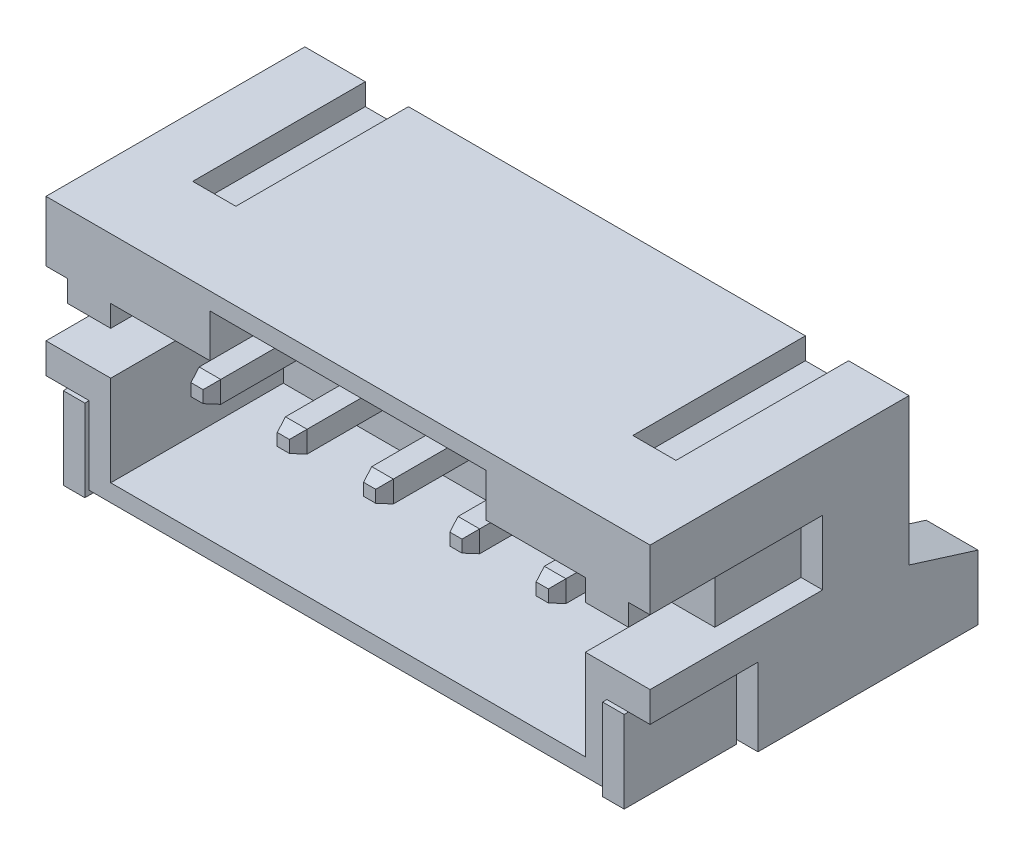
from build123d import *
from OCP.BRepFilletAPI import BRepFilletAPI_MakeChamfer

# Parameters (mm, degrees)
EXTRUDE_1_DEPTH                     = 7
SKETCH_2_W                          = 0.5
SKETCH_2_H                          = 1.5
CUT_EXTRUDE_2_DEPTH                 = 4
SKETCH_3_W                          = 11.6
SKETCH_3_H                          = 1.6
CUT_EXTRUDE_3_DEPTH                 = 12.658473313
SKETCH_5_W                          = 0.9
SKETCH_5_H                          = 1.8
CUT_EXTRUDE_5_DEPTH                 = 2.5
EXTRUDE_4_DEPTH                     = 0.25
CHAMFER_1_SIZE                      = 0.3
CHAMFER_1_SIZE2                     = 0.10919107
EXTRUDE_6_DEPTH                     = 0.1
EXTRUDE_6_DEPTH_BACK                = 2.5
SKETCH_6_W                          = 0.5
SKETCH_6_H                          = 1.9
PATTERN_LINEAR_1_COUNT              = 5
PATTERN_LINEAR_1_PITCH              = 2
CHAMFER_1_OF_PATTERN_LINEAR_1_SIZE  = 0.3
CHAMFER_1_OF_PATTERN_LINEAR_1_SIZE2 = 0.10919107
SKETCH_7_W                          = 1
SKETCH_7_H                          = 4
CUT_EXTRUDE_7_DEPTH                 = 0.5


with BuildPart() as part:
    # Sketch 1 → Extrude 1 (new, symmetric)
    with BuildSketch(Plane(origin=(0, 0, 0), x_dir=(0, 0, -1), z_dir=(1, 0, 0))):
        Polygon((7.6, 1.6), (6, 2.1), (6, 5.5), (0, 5.5), (0, 3.6), (2, 3.6), (2, 2.6), (0, 2.6), (0, 0.1), (7.6, 0.1), align=None)
    extrude(amount=EXTRUDE_1_DEPTH, both=True)

    # Sketch 2 → Cut-Extrude 2 (cut)
    with BuildSketch(Plane.XY):
        Polygon((-5.5, 0.5), (5.5, 0.5), (5.5, 4.1), (3.2, 4.1), (3.2, 5.1), (-3.2, 5.1), (-3.2, 4.1), (-5.5, 4.1), align=None)
        with Locations((-6.75, 3.35)):
            Rectangle(SKETCH_2_W, SKETCH_2_H)
        with Locations((6.75, 3.35)):
            Rectangle(SKETCH_2_W, SKETCH_2_H)
    extrude(amount=-CUT_EXTRUDE_2_DEPTH, mode=Mode.SUBTRACT)

    # Sketch 3 → Cut-Extrude 3 (cut, through all)
    with BuildSketch(Plane(origin=(0, 5.5, 0), x_dir=(1, 0, 0), z_dir=(0, 1, 0))):
        with Locations((0, 6.8)):
            Rectangle(SKETCH_3_W, SKETCH_3_H)
    extrude(amount=-CUT_EXTRUDE_3_DEPTH, mode=Mode.SUBTRACT)

    # Sketch 5 → Cut-Extrude 5 (cut)
    with BuildSketch(Plane.XY):
        with Locations((-6.55, 1)):
            Rectangle(SKETCH_5_W, SKETCH_5_H)
        with Locations((6.55, 1)):
            Rectangle(SKETCH_5_W, SKETCH_5_H)
    extrude(amount=-CUT_EXTRUDE_5_DEPTH, mode=Mode.SUBTRACT)

    # Sketch 4 → Extrude 4 (add, symmetric)
    with BuildSketch(Plane.ZY.offset(4)):
        with BuildLine():
            Line((-0.5, 2.55), (-5.6, 2.55))
            ThreePointArc((-5.6, 2.55), (-5.953553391, 2.403553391), (-6.1, 2.05))
            Line((-6.1, 2.05), (-6.1, 1))
            ThreePointArc((-6.1, 1), (-6.392893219, 0.292893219), (-7.1, 0))
            Line((-7.1, 0), (-8.6, 0))
            Line((-8.6, 0), (-8.6, 0.5))
            Line((-8.6, 0.5), (-7.1, 0.5))
            ThreePointArc((-7.1, 0.5), (-6.746446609, 0.646446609), (-6.6, 1))
            Line((-6.6, 1), (-6.6, 2.05))
            ThreePointArc((-6.6, 2.05), (-6.307106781, 2.757106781), (-5.6, 3.05))
            Line((-5.6, 3.05), (-0.5, 3.05))
            Line((-0.5, 3.05), (-0.5, 2.55))
        make_face()
    extrude_4 = extrude(amount=EXTRUDE_4_DEPTH, both=True)

    # Chamfer 1: one chamfer whose edges measure the first distance from different faces: ONE call of the kernel's chamfer builder (chamfer() names one face for all edges)
    chamfer_1_edges_1 = [part.edges().sort_by_distance(p)[0] for p in [
        (-4, 3.05, -0.5),
    ]]
    chamfer_1_side_1 = [part.faces().sort_by_distance(p)[0] for p in [
        (-4, 3.05, -2.25),
    ]]
    chamfer_1_edges_2 = [part.edges().sort_by_distance(p)[0] for p in [
        (-4.25, 2.8, -0.5),
    ]]
    chamfer_1_side_2 = [part.faces().sort_by_distance(p)[0] for p in [
        (-4.25, 2.8, -2.25),
    ]]
    chamfer_1_edges_3 = [part.edges().sort_by_distance(p)[0] for p in [
        (-3.75, 2.8, -0.5),
    ]]
    chamfer_1_side_3 = [part.faces().sort_by_distance(p)[0] for p in [
        (-3.75, 2.8, -2.25),
    ]]
    chamfer_1_edges_4 = [part.edges().sort_by_distance(p)[0] for p in [
        (-4, 2.55, -0.5),
    ]]
    chamfer_1_side_4 = [part.faces().sort_by_distance(p)[0] for p in [
        (-4, 2.55, -2.25),
    ]]
    chamfer_1 = BRepFilletAPI_MakeChamfer(part.part.solid().wrapped)
    for e in chamfer_1_edges_1:
        chamfer_1.Add(CHAMFER_1_SIZE, CHAMFER_1_SIZE2, e.wrapped, chamfer_1_side_1[0].wrapped)  # the first distance lies on this face
    for e in chamfer_1_edges_2:
        chamfer_1.Add(CHAMFER_1_SIZE, CHAMFER_1_SIZE2, e.wrapped, chamfer_1_side_2[0].wrapped)  # the first distance lies on this face
    for e in chamfer_1_edges_3:
        chamfer_1.Add(CHAMFER_1_SIZE, CHAMFER_1_SIZE2, e.wrapped, chamfer_1_side_3[0].wrapped)  # the first distance lies on this face
    for e in chamfer_1_edges_4:
        chamfer_1.Add(CHAMFER_1_SIZE, CHAMFER_1_SIZE2, e.wrapped, chamfer_1_side_4[0].wrapped)  # the first distance lies on this face
    add(Compound.cast(chamfer_1.Shape()), mode=Mode.REPLACE)

    # Sketch 6 → Extrude 6 (add, two sides: drawn at the far end of the back side and taken through both)
    with BuildSketch(Plane.XY.offset(-EXTRUDE_6_DEPTH_BACK)):
        with Locations((-6.25, 0.95)):
            Rectangle(SKETCH_6_W, SKETCH_6_H)
        with Locations((6.25, 0.95)):
            Rectangle(SKETCH_6_W, SKETCH_6_H)
    extrude(amount=EXTRUDE_6_DEPTH + EXTRUDE_6_DEPTH_BACK)

    # Pattern Linear 1: Extrude 4 ×5
    with Locations(*[(i * PATTERN_LINEAR_1_PITCH, 0, 0) for i in range(1, PATTERN_LINEAR_1_COUNT)]):
        add(extrude_4)

    # Chamfer 1 of Pattern Linear 1: one chamfer whose edges measure the first distance from different faces: ONE call of the kernel's chamfer builder (chamfer() names one face for all edges)
    chamfer_1_of_pattern_linear_1_edges_1 = [part.edges().sort_by_distance(p)[0] for p in [
        (-2, 3.05, -0.5),
    ]]
    chamfer_1_of_pattern_linear_1_side_1 = [part.faces().sort_by_distance(p)[0] for p in [
        (-2, 3.05, -2.25),
    ]]
    chamfer_1_of_pattern_linear_1_edges_2 = [part.edges().sort_by_distance(p)[0] for p in [
        (-2.25, 2.8, -0.5),
    ]]
    chamfer_1_of_pattern_linear_1_side_2 = [part.faces().sort_by_distance(p)[0] for p in [
        (-2.25, 2.8, -2.25),
    ]]
    chamfer_1_of_pattern_linear_1_edges_3 = [part.edges().sort_by_distance(p)[0] for p in [
        (-1.75, 2.8, -0.5),
    ]]
    chamfer_1_of_pattern_linear_1_side_3 = [part.faces().sort_by_distance(p)[0] for p in [
        (-1.75, 2.8, -2.25),
    ]]
    chamfer_1_of_pattern_linear_1_edges_4 = [part.edges().sort_by_distance(p)[0] for p in [
        (-2, 2.55, -0.5),
    ]]
    chamfer_1_of_pattern_linear_1_side_4 = [part.faces().sort_by_distance(p)[0] for p in [
        (-2, 2.55, -2.25),
    ]]
    chamfer_1_of_pattern_linear_1_edges_5 = [part.edges().sort_by_distance(p)[0] for p in [
        (0, 3.05, -0.5),
    ]]
    chamfer_1_of_pattern_linear_1_side_5 = [part.faces().sort_by_distance(p)[0] for p in [
        (0, 3.05, -2.25),
    ]]
    chamfer_1_of_pattern_linear_1_edges_6 = [part.edges().sort_by_distance(p)[0] for p in [
        (-0.25, 2.8, -0.5),
    ]]
    chamfer_1_of_pattern_linear_1_side_6 = [part.faces().sort_by_distance(p)[0] for p in [
        (-0.25, 2.8, -2.25),
    ]]
    chamfer_1_of_pattern_linear_1_edges_7 = [part.edges().sort_by_distance(p)[0] for p in [
        (0.25, 2.8, -0.5),
    ]]
    chamfer_1_of_pattern_linear_1_side_7 = [part.faces().sort_by_distance(p)[0] for p in [
        (0.25, 2.8, -2.25),
    ]]
    chamfer_1_of_pattern_linear_1_edges_8 = [part.edges().sort_by_distance(p)[0] for p in [
        (0, 2.55, -0.5),
    ]]
    chamfer_1_of_pattern_linear_1_side_8 = [part.faces().sort_by_distance(p)[0] for p in [
        (0, 2.55, -2.25),
    ]]
    chamfer_1_of_pattern_linear_1_edges_9 = [part.edges().sort_by_distance(p)[0] for p in [
        (2, 3.05, -0.5),
    ]]
    chamfer_1_of_pattern_linear_1_side_9 = [part.faces().sort_by_distance(p)[0] for p in [
        (2, 3.05, -2.25),
    ]]
    chamfer_1_of_pattern_linear_1_edges_10 = [part.edges().sort_by_distance(p)[0] for p in [
        (1.75, 2.8, -0.5),
    ]]
    chamfer_1_of_pattern_linear_1_side_10 = [part.faces().sort_by_distance(p)[0] for p in [
        (1.75, 2.8, -2.25),
    ]]
    chamfer_1_of_pattern_linear_1_edges_11 = [part.edges().sort_by_distance(p)[0] for p in [
        (2.25, 2.8, -0.5),
    ]]
    chamfer_1_of_pattern_linear_1_side_11 = [part.faces().sort_by_distance(p)[0] for p in [
        (2.25, 2.8, -2.25),
    ]]
    chamfer_1_of_pattern_linear_1_edges_12 = [part.edges().sort_by_distance(p)[0] for p in [
        (2, 2.55, -0.5),
    ]]
    chamfer_1_of_pattern_linear_1_side_12 = [part.faces().sort_by_distance(p)[0] for p in [
        (2, 2.55, -2.25),
    ]]
    chamfer_1_of_pattern_linear_1_edges_13 = [part.edges().sort_by_distance(p)[0] for p in [
        (4, 3.05, -0.5),
    ]]
    chamfer_1_of_pattern_linear_1_side_13 = [part.faces().sort_by_distance(p)[0] for p in [
        (4, 3.05, -2.25),
    ]]
    chamfer_1_of_pattern_linear_1_edges_14 = [part.edges().sort_by_distance(p)[0] for p in [
        (3.75, 2.8, -0.5),
    ]]
    chamfer_1_of_pattern_linear_1_side_14 = [part.faces().sort_by_distance(p)[0] for p in [
        (3.75, 2.8, -2.25),
    ]]
    chamfer_1_of_pattern_linear_1_edges_15 = [part.edges().sort_by_distance(p)[0] for p in [
        (4.25, 2.8, -0.5),
    ]]
    chamfer_1_of_pattern_linear_1_side_15 = [part.faces().sort_by_distance(p)[0] for p in [
        (4.25, 2.8, -2.25),
    ]]
    chamfer_1_of_pattern_linear_1_edges_16 = [part.edges().sort_by_distance(p)[0] for p in [
        (4, 2.55, -0.5),
    ]]
    chamfer_1_of_pattern_linear_1_side_16 = [part.faces().sort_by_distance(p)[0] for p in [
        (4, 2.55, -2.25),
    ]]
    chamfer_1_of_pattern_linear_1 = BRepFilletAPI_MakeChamfer(part.part.solid().wrapped)
    for e in chamfer_1_of_pattern_linear_1_edges_1:
        chamfer_1_of_pattern_linear_1.Add(CHAMFER_1_OF_PATTERN_LINEAR_1_SIZE, CHAMFER_1_OF_PATTERN_LINEAR_1_SIZE2, e.wrapped, chamfer_1_of_pattern_linear_1_side_1[0].wrapped)  # the first distance lies on this face
    for e in chamfer_1_of_pattern_linear_1_edges_2:
        chamfer_1_of_pattern_linear_1.Add(CHAMFER_1_OF_PATTERN_LINEAR_1_SIZE, CHAMFER_1_OF_PATTERN_LINEAR_1_SIZE2, e.wrapped, chamfer_1_of_pattern_linear_1_side_2[0].wrapped)  # the first distance lies on this face
    for e in chamfer_1_of_pattern_linear_1_edges_3:
        chamfer_1_of_pattern_linear_1.Add(CHAMFER_1_OF_PATTERN_LINEAR_1_SIZE, CHAMFER_1_OF_PATTERN_LINEAR_1_SIZE2, e.wrapped, chamfer_1_of_pattern_linear_1_side_3[0].wrapped)  # the first distance lies on this face
    for e in chamfer_1_of_pattern_linear_1_edges_4:
        chamfer_1_of_pattern_linear_1.Add(CHAMFER_1_OF_PATTERN_LINEAR_1_SIZE, CHAMFER_1_OF_PATTERN_LINEAR_1_SIZE2, e.wrapped, chamfer_1_of_pattern_linear_1_side_4[0].wrapped)  # the first distance lies on this face
    for e in chamfer_1_of_pattern_linear_1_edges_5:
        chamfer_1_of_pattern_linear_1.Add(CHAMFER_1_OF_PATTERN_LINEAR_1_SIZE, CHAMFER_1_OF_PATTERN_LINEAR_1_SIZE2, e.wrapped, chamfer_1_of_pattern_linear_1_side_5[0].wrapped)  # the first distance lies on this face
    for e in chamfer_1_of_pattern_linear_1_edges_6:
        chamfer_1_of_pattern_linear_1.Add(CHAMFER_1_OF_PATTERN_LINEAR_1_SIZE, CHAMFER_1_OF_PATTERN_LINEAR_1_SIZE2, e.wrapped, chamfer_1_of_pattern_linear_1_side_6[0].wrapped)  # the first distance lies on this face
    for e in chamfer_1_of_pattern_linear_1_edges_7:
        chamfer_1_of_pattern_linear_1.Add(CHAMFER_1_OF_PATTERN_LINEAR_1_SIZE, CHAMFER_1_OF_PATTERN_LINEAR_1_SIZE2, e.wrapped, chamfer_1_of_pattern_linear_1_side_7[0].wrapped)  # the first distance lies on this face
    for e in chamfer_1_of_pattern_linear_1_edges_8:
        chamfer_1_of_pattern_linear_1.Add(CHAMFER_1_OF_PATTERN_LINEAR_1_SIZE, CHAMFER_1_OF_PATTERN_LINEAR_1_SIZE2, e.wrapped, chamfer_1_of_pattern_linear_1_side_8[0].wrapped)  # the first distance lies on this face
    for e in chamfer_1_of_pattern_linear_1_edges_9:
        chamfer_1_of_pattern_linear_1.Add(CHAMFER_1_OF_PATTERN_LINEAR_1_SIZE, CHAMFER_1_OF_PATTERN_LINEAR_1_SIZE2, e.wrapped, chamfer_1_of_pattern_linear_1_side_9[0].wrapped)  # the first distance lies on this face
    for e in chamfer_1_of_pattern_linear_1_edges_10:
        chamfer_1_of_pattern_linear_1.Add(CHAMFER_1_OF_PATTERN_LINEAR_1_SIZE, CHAMFER_1_OF_PATTERN_LINEAR_1_SIZE2, e.wrapped, chamfer_1_of_pattern_linear_1_side_10[0].wrapped)  # the first distance lies on this face
    for e in chamfer_1_of_pattern_linear_1_edges_11:
        chamfer_1_of_pattern_linear_1.Add(CHAMFER_1_OF_PATTERN_LINEAR_1_SIZE, CHAMFER_1_OF_PATTERN_LINEAR_1_SIZE2, e.wrapped, chamfer_1_of_pattern_linear_1_side_11[0].wrapped)  # the first distance lies on this face
    for e in chamfer_1_of_pattern_linear_1_edges_12:
        chamfer_1_of_pattern_linear_1.Add(CHAMFER_1_OF_PATTERN_LINEAR_1_SIZE, CHAMFER_1_OF_PATTERN_LINEAR_1_SIZE2, e.wrapped, chamfer_1_of_pattern_linear_1_side_12[0].wrapped)  # the first distance lies on this face
    for e in chamfer_1_of_pattern_linear_1_edges_13:
        chamfer_1_of_pattern_linear_1.Add(CHAMFER_1_OF_PATTERN_LINEAR_1_SIZE, CHAMFER_1_OF_PATTERN_LINEAR_1_SIZE2, e.wrapped, chamfer_1_of_pattern_linear_1_side_13[0].wrapped)  # the first distance lies on this face
    for e in chamfer_1_of_pattern_linear_1_edges_14:
        chamfer_1_of_pattern_linear_1.Add(CHAMFER_1_OF_PATTERN_LINEAR_1_SIZE, CHAMFER_1_OF_PATTERN_LINEAR_1_SIZE2, e.wrapped, chamfer_1_of_pattern_linear_1_side_14[0].wrapped)  # the first distance lies on this face
    for e in chamfer_1_of_pattern_linear_1_edges_15:
        chamfer_1_of_pattern_linear_1.Add(CHAMFER_1_OF_PATTERN_LINEAR_1_SIZE, CHAMFER_1_OF_PATTERN_LINEAR_1_SIZE2, e.wrapped, chamfer_1_of_pattern_linear_1_side_15[0].wrapped)  # the first distance lies on this face
    for e in chamfer_1_of_pattern_linear_1_edges_16:
        chamfer_1_of_pattern_linear_1.Add(CHAMFER_1_OF_PATTERN_LINEAR_1_SIZE, CHAMFER_1_OF_PATTERN_LINEAR_1_SIZE2, e.wrapped, chamfer_1_of_pattern_linear_1_side_16[0].wrapped)  # the first distance lies on this face
    add(Compound.cast(chamfer_1_of_pattern_linear_1.Shape()), mode=Mode.REPLACE)

    # Sketch 7 → Cut-Extrude 7 (cut)
    with BuildSketch(Plane(origin=(0, 5.5, 0), x_dir=(1, 0, 0), z_dir=(0, 1, 0))):
        with Locations((-5.1, 4)):
            Rectangle(SKETCH_7_W, SKETCH_7_H)
        with Locations((5.1, 4)):
            Rectangle(SKETCH_7_W, SKETCH_7_H)
    extrude(amount=-CUT_EXTRUDE_7_DEPTH, mode=Mode.SUBTRACT)


solid = part.part
